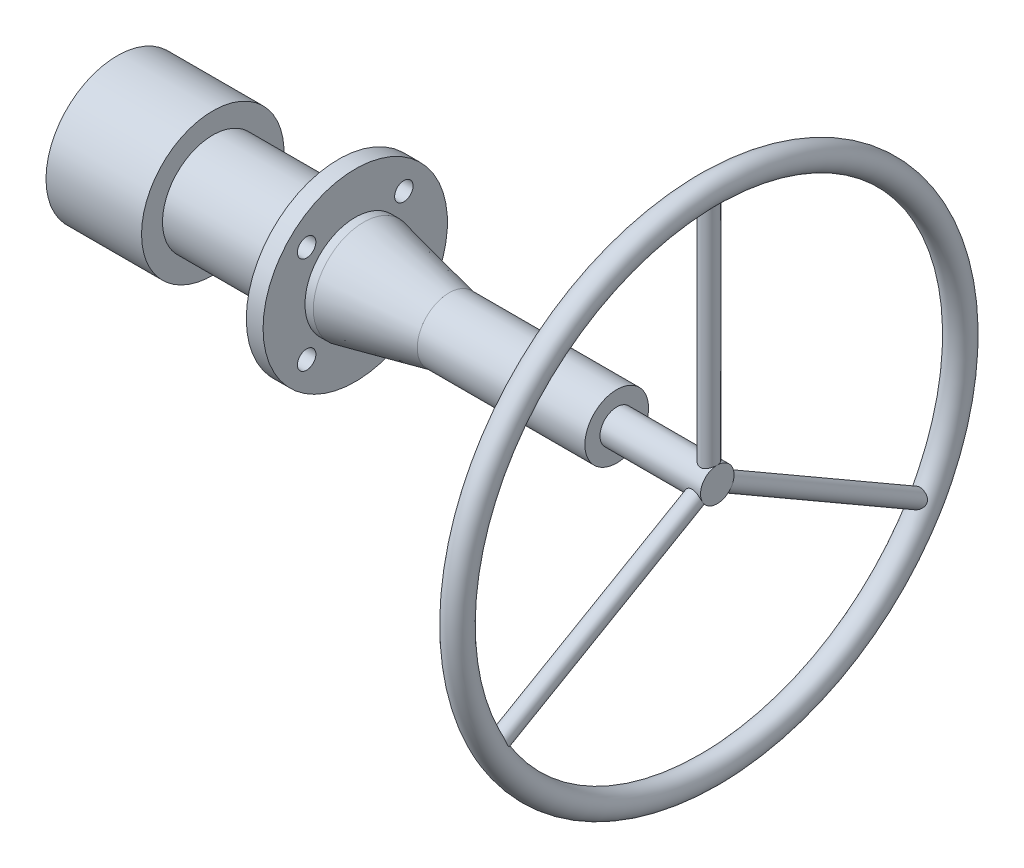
from build123d import *
from build123d.topology import SkipClean

# Parameters (mm, degrees)
SKETCH_2_R               = 5.5
CUT_EXTRUDE_1_DEPTH      = 10
SKETCH_4_R               = 7.5
SKETCH_5_R               = 5
EXTRUDE_1_DEPTH          = 150
PATTERN_CIRCULAR_1_COUNT = 3


with BuildPart() as part:
    # Sketch 1 → Revolve 1 (revolve)
    with BuildSketch(Plane.XY, mode=Mode.PRIVATE) as revolve_1_sk:
        Polygon((0, 0), (358, 0), (358, 10), (298, 10), (298, 19), (198, 19), (147, 30), (142, 30), (142, 55), (132, 55), (132, 30), (57, 30), (57, 42.5), (0, 42.5), align=None)
    revolve(revolve_1_sk.sketch.rotate(Axis((0, 0, 0), (1, 0, 0)), 90), axis=Axis((0, 0, 0), (1, 0, 0)))

    # Sketch 2 → Cut-Extrude 1 (cut)
    with BuildSketch(Plane(origin=(142, 0, 0), x_dir=(0, 0, -1), z_dir=(1, 0, 0))):
        with Locations((-29, 29)):
            Circle(SKETCH_2_R)
        with Locations((29, 29)):
            Circle(SKETCH_2_R)
        with Locations((29, -29)):
            Circle(SKETCH_2_R)
        with Locations((-29, -29)):
            Circle(SKETCH_2_R)
    extrude(amount=-CUT_EXTRUDE_1_DEPTH, mode=Mode.SUBTRACT)



with BuildPart() as body_2:
    # Sweep 1: sweep along a path in Sketch 3
    with BuildLine(Plane(origin=(353, 0, 0), x_dir=(0, 0, -1), z_dir=(1, 0, 0))) as sweep_1_path:
        CenterArc((0, 0), 150, 0, 360)
    # Sketch 4 → Sweep 1 (sweep)
    with BuildSketch(Plane.XY):
        with Locations((353, 150)):
            Circle(SKETCH_4_R)
    sweep(path=sweep_1_path.line)


with BuildPart() as part_1:
    with SkipClean():  # the faces are left unmerged after this step: merging them gives an invalid solid
        add(part.part)

        add(body_2.part)  # Extrude 1 merges body 2
        # Sketch 5 → Extrude 1 (add)
        with BuildSketch(Plane(origin=(0, 0, 0), x_dir=(1, 0, 0), z_dir=(0, 1, 0))):
            with Locations(Location((353, 0, 0), (0, 0, 145.066566))):
                Circle(SKETCH_5_R)
        extrude_1 = extrude(amount=EXTRUDE_1_DEPTH)

    # Pattern Circular 1: Extrude 1 ×3 about axis
    with SkipClean():  # the faces are left unmerged after this step: merging them gives an invalid solid
        pattern_circular_1_axis = Axis((0, 0, 0), (1, 0, 0))
        for i in range(1, PATTERN_CIRCULAR_1_COUNT):
            add(extrude_1.rotate(pattern_circular_1_axis, i * 360 / PATTERN_CIRCULAR_1_COUNT))


solid = part_1.part
